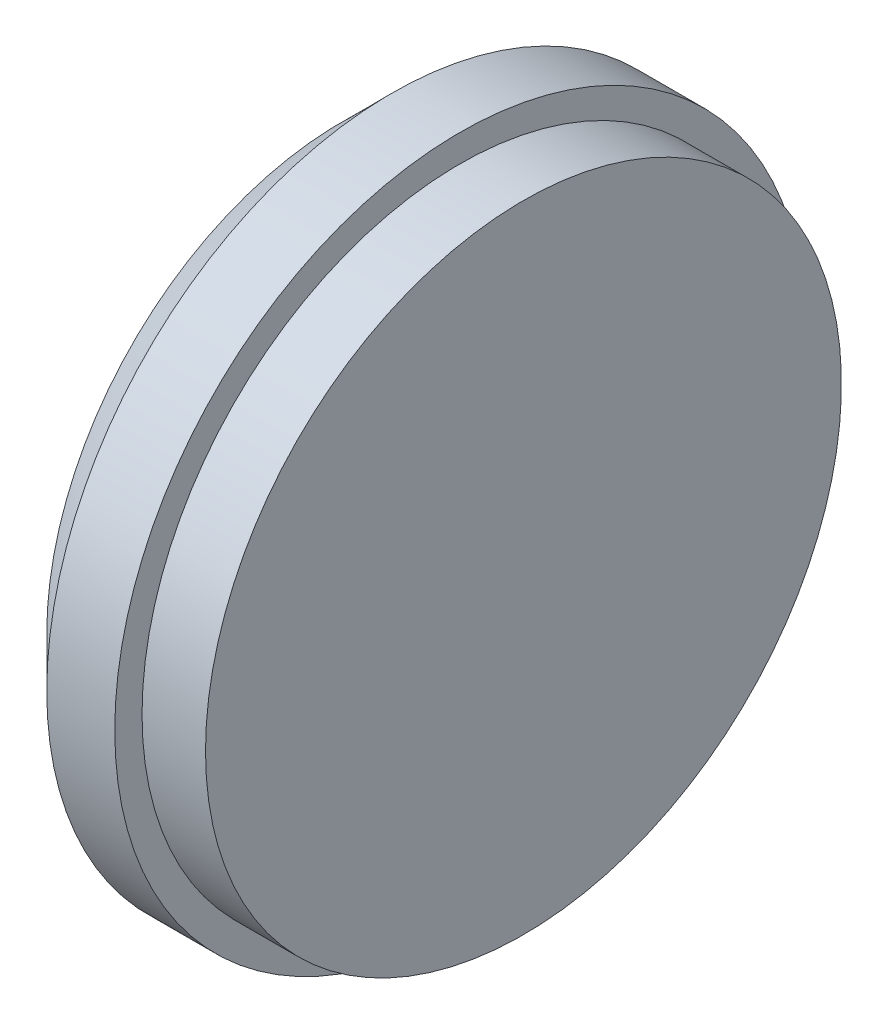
ISO-10303-21;
HEADER;
FILE_DESCRIPTION(('STEP AP214'),'2;1');
FILE_NAME('part.step','',(''),(''),'','','');
FILE_SCHEMA(('AUTOMOTIVE_DESIGN { 1 0 10303 214 1 1 1 1 }'));
ENDSEC;
DATA;
#1=APPLICATION_CONTEXT('core data for automotive mechanical design processes');
#2=APPLICATION_PROTOCOL_DEFINITION('international standard','automotive_design',2000,#1);
#3=PRODUCT_CONTEXT('',#1,'mechanical');
#4=PRODUCT('Part','Part','',(#3));
#5=PRODUCT_RELATED_PRODUCT_CATEGORY('part','',(#4));
#6=PRODUCT_DEFINITION_FORMATION('','',#4);
#7=PRODUCT_DEFINITION_CONTEXT('part definition',#1,'design');
#8=PRODUCT_DEFINITION('design','',#6,#7);
#9=PRODUCT_DEFINITION_SHAPE('','',#8);
#10=(LENGTH_UNIT() NAMED_UNIT(*) SI_UNIT(.MILLI.,.METRE.));
#11=(NAMED_UNIT(*) PLANE_ANGLE_UNIT() SI_UNIT($,.RADIAN.));
#12=(NAMED_UNIT(*) SI_UNIT($,.STERADIAN.) SOLID_ANGLE_UNIT());
#13=UNCERTAINTY_MEASURE_WITH_UNIT(LENGTH_MEASURE(1.E-05),#10,'distance_accuracy_value','');
#14=(GEOMETRIC_REPRESENTATION_CONTEXT(3) GLOBAL_UNCERTAINTY_ASSIGNED_CONTEXT((#13)) GLOBAL_UNIT_ASSIGNED_CONTEXT((#10,
#11,#12)) REPRESENTATION_CONTEXT('',''));
#15=CARTESIAN_POINT('',(0.,0.,0.));
#16=DIRECTION('',(0.,0.,1.));
#17=DIRECTION('',(1.,0.,0.));
#18=AXIS2_PLACEMENT_3D('',#15,#16,#17);
#19=CARTESIAN_POINT('',(-6.34745999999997,24.5846600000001,0.));
#20=DIRECTION('',(1.,0.,0.));
#21=DIRECTION('',(0.,0.,-1.));
#22=AXIS2_PLACEMENT_3D('',#19,#20,#21);
#23=PLANE('',#22);
#24=CARTESIAN_POINT('',(-6.34745999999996,24.5846600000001,0.));
#25=DIRECTION('',(-1.,0.,0.));
#26=DIRECTION('',(0.,0.,1.));
#27=AXIS2_PLACEMENT_3D('',#24,#25,#26);
#28=CIRCLE('',#27,27.8384);
#29=CARTESIAN_POINT('',(-6.34745999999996,24.5846600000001,27.8384));
#30=VERTEX_POINT('',#29);
#31=EDGE_CURVE('E10',#30,#30,#28,.T.);
#32=ORIENTED_EDGE('',*,*,#31,.F.);
#33=EDGE_LOOP('',(#32));
#34=FACE_BOUND('',#33,.T.);
#35=ADVANCED_FACE('F31',(#34),#23,.T.);
#36=CARTESIAN_POINT('',(-22.22246,24.5846600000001,0.));
#37=DIRECTION('',(-1.,0.,0.));
#38=DIRECTION('',(0.,0.,1.));
#39=AXIS2_PLACEMENT_3D('',#36,#37,#38);
#40=CYLINDRICAL_SURFACE('',#39,27.8384);
#41=ORIENTED_EDGE('',*,*,#31,.T.);
#42=EDGE_LOOP('',(#41));
#43=FACE_BOUND('',#42,.T.);
#44=CARTESIAN_POINT('',(-11.90498,24.5846600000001,0.));
#45=DIRECTION('',(-1.,0.,0.));
#46=DIRECTION('',(0.,0.,1.));
#47=AXIS2_PLACEMENT_3D('',#44,#45,#46);
#48=CIRCLE('',#47,27.8384);
#49=CARTESIAN_POINT('',(-11.90498,24.5846600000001,27.8384));
#50=VERTEX_POINT('',#49);
#51=EDGE_CURVE('E37',#50,#50,#48,.T.);
#52=ORIENTED_EDGE('',*,*,#51,.F.);
#53=EDGE_LOOP('',(#52));
#54=FACE_BOUND('',#53,.T.);
#55=ADVANCED_FACE('F70',(#43,#54),#40,.T.);
#56=CARTESIAN_POINT('',(-11.90498,-3.25373999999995,0.));
#57=DIRECTION('',(1.,0.,0.));
#58=DIRECTION('',(0.,0.,-1.));
#59=AXIS2_PLACEMENT_3D('',#56,#57,#58);
#60=PLANE('',#59);
#61=ORIENTED_EDGE('',*,*,#51,.T.);
#62=EDGE_LOOP('',(#61));
#63=FACE_BOUND('',#62,.T.);
#64=CARTESIAN_POINT('',(-11.90498,24.5846600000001,0.));
#65=DIRECTION('',(-1.,0.,0.));
#66=DIRECTION('',(0.,0.,1.));
#67=AXIS2_PLACEMENT_3D('',#64,#65,#66);
#68=CIRCLE('',#67,30.226);
#69=CARTESIAN_POINT('',(-11.90498,24.5846600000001,30.226));
#70=VERTEX_POINT('',#69);
#71=EDGE_CURVE('E41',#70,#70,#68,.T.);
#72=ORIENTED_EDGE('',*,*,#71,.F.);
#73=EDGE_LOOP('',(#72));
#74=FACE_BOUND('',#73,.T.);
#75=ADVANCED_FACE('F66',(#63,#74),#60,.T.);
#76=CARTESIAN_POINT('',(-22.22246,24.5846600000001,0.));
#77=DIRECTION('',(-1.,0.,0.));
#78=DIRECTION('',(0.,0.,1.));
#79=AXIS2_PLACEMENT_3D('',#76,#77,#78);
#80=CYLINDRICAL_SURFACE('',#79,30.226);
#81=ORIENTED_EDGE('',*,*,#71,.T.);
#82=EDGE_LOOP('',(#81));
#83=FACE_BOUND('',#82,.T.);
#84=CARTESIAN_POINT('',(-17.85874,24.5846600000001,0.));
#85=DIRECTION('',(-1.,0.,0.));
#86=DIRECTION('',(0.,0.,1.));
#87=AXIS2_PLACEMENT_3D('',#84,#85,#86);
#88=CIRCLE('',#87,30.226);
#89=CARTESIAN_POINT('',(-17.85874,24.5846600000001,30.226));
#90=VERTEX_POINT('',#89);
#91=EDGE_CURVE('E45',#90,#90,#88,.T.);
#92=ORIENTED_EDGE('',*,*,#91,.F.);
#93=EDGE_LOOP('',(#92));
#94=FACE_BOUND('',#93,.T.);
#95=ADVANCED_FACE('F58',(#83,#94),#80,.T.);
#96=CARTESIAN_POINT('',(-22.22246,24.5846600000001,0.));
#97=DIRECTION('',(1.,0.,0.));
#98=DIRECTION('',(0.,0.,-1.));
#99=AXIS2_PLACEMENT_3D('',#96,#97,#98);
#100=CONICAL_SURFACE('',#99,25.86228,0.785398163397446);
#101=ORIENTED_EDGE('',*,*,#91,.T.);
#102=EDGE_LOOP('',(#101));
#103=FACE_BOUND('',#102,.T.);
#104=CARTESIAN_POINT('',(-22.22246,24.5846600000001,0.));
#105=DIRECTION('',(-1.,0.,0.));
#106=DIRECTION('',(0.,0.,1.));
#107=AXIS2_PLACEMENT_3D('',#104,#105,#106);
#108=CIRCLE('',#107,25.86228);
#109=CARTESIAN_POINT('',(-22.22246,24.5846600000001,25.86228));
#110=VERTEX_POINT('',#109);
#111=EDGE_CURVE('E50',#110,#110,#108,.T.);
#112=ORIENTED_EDGE('',*,*,#111,.F.);
#113=EDGE_LOOP('',(#112));
#114=FACE_BOUND('',#113,.T.);
#115=ADVANCED_FACE('F56',(#103,#114),#100,.T.);
#116=CARTESIAN_POINT('',(-22.22246,-1.27761999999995,0.));
#117=DIRECTION('',(-1.,0.,0.));
#118=DIRECTION('',(0.,0.,1.));
#119=AXIS2_PLACEMENT_3D('',#116,#117,#118);
#120=PLANE('',#119);
#121=ORIENTED_EDGE('',*,*,#111,.T.);
#122=EDGE_LOOP('',(#121));
#123=FACE_BOUND('',#122,.T.);
#124=ADVANCED_FACE('F54',(#123),#120,.T.);
#125=CLOSED_SHELL('',(#35,#55,#75,#95,#115,#124));
#126=MANIFOLD_SOLID_BREP('B2',#125);
#127=ADVANCED_BREP_SHAPE_REPRESENTATION('',(#18,#126),#14);
#128=SHAPE_DEFINITION_REPRESENTATION(#9,#127);
ENDSEC;
END-ISO-10303-21;
